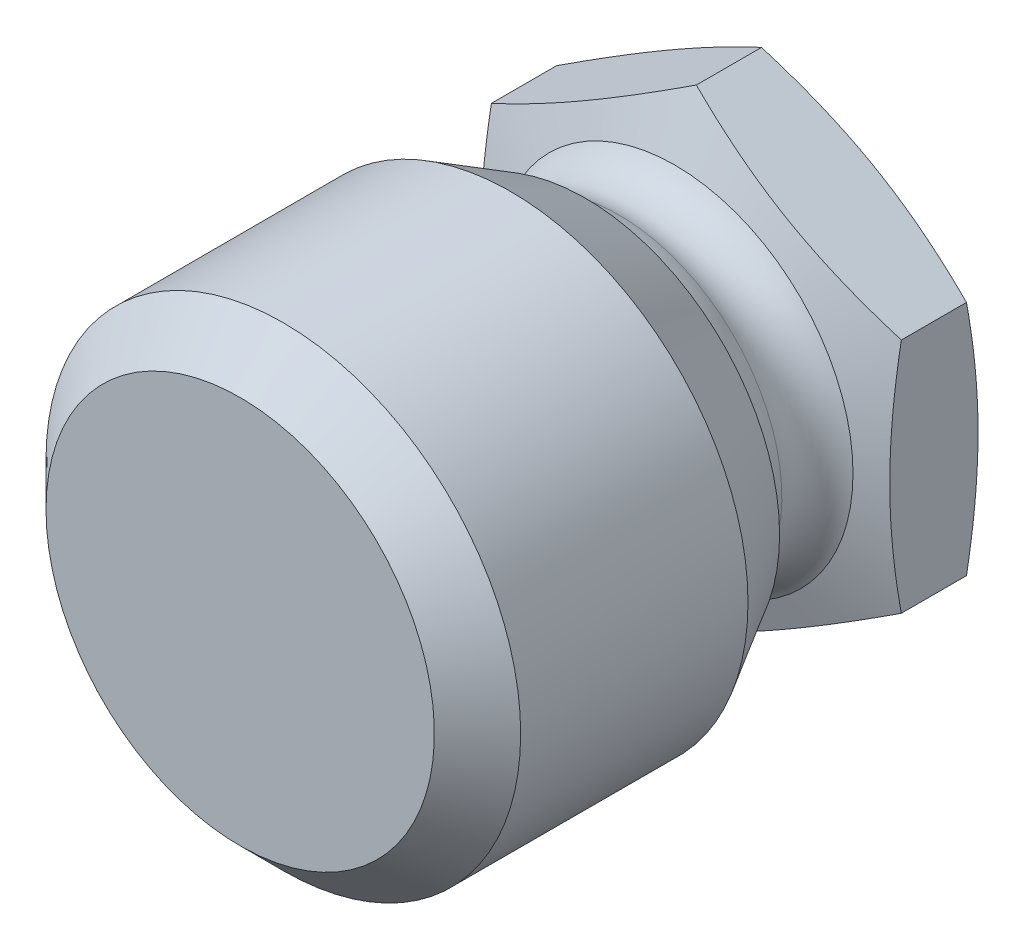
ISO-10303-21;
HEADER;
FILE_DESCRIPTION(('STEP AP214'),'2;1');
FILE_NAME('part.step','',(''),(''),'','','');
FILE_SCHEMA(('AUTOMOTIVE_DESIGN { 1 0 10303 214 1 1 1 1 }'));
ENDSEC;
DATA;
#1=APPLICATION_CONTEXT('core data for automotive mechanical design processes');
#2=APPLICATION_PROTOCOL_DEFINITION('international standard','automotive_design',2000,#1);
#3=PRODUCT_CONTEXT('',#1,'mechanical');
#4=PRODUCT('Part','Part','',(#3));
#5=PRODUCT_RELATED_PRODUCT_CATEGORY('part','',(#4));
#6=PRODUCT_DEFINITION_FORMATION('','',#4);
#7=PRODUCT_DEFINITION_CONTEXT('part definition',#1,'design');
#8=PRODUCT_DEFINITION('design','',#6,#7);
#9=PRODUCT_DEFINITION_SHAPE('','',#8);
#10=(LENGTH_UNIT() NAMED_UNIT(*) SI_UNIT(.MILLI.,.METRE.));
#11=(NAMED_UNIT(*) PLANE_ANGLE_UNIT() SI_UNIT($,.RADIAN.));
#12=(NAMED_UNIT(*) SI_UNIT($,.STERADIAN.) SOLID_ANGLE_UNIT());
#13=UNCERTAINTY_MEASURE_WITH_UNIT(LENGTH_MEASURE(1.E-05),#10,'distance_accuracy_value','');
#14=(GEOMETRIC_REPRESENTATION_CONTEXT(3) GLOBAL_UNCERTAINTY_ASSIGNED_CONTEXT((#13)) GLOBAL_UNIT_ASSIGNED_CONTEXT((#10,
#11,#12)) REPRESENTATION_CONTEXT('',''));
#15=CARTESIAN_POINT('',(0.,0.,0.));
#16=DIRECTION('',(0.,0.,1.));
#17=DIRECTION('',(1.,0.,0.));
#18=AXIS2_PLACEMENT_3D('',#15,#16,#17);
#19=CARTESIAN_POINT('',(0.,0.,11.5));
#20=DIRECTION('',(0.,0.,-1.));
#21=DIRECTION('',(0.,-1.,0.));
#22=AXIS2_PLACEMENT_3D('',#19,#20,#21);
#23=SPHERICAL_SURFACE('',#22,8.5);
#24=CARTESIAN_POINT('',(0.,0.,7.60077445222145));
#25=DIRECTION('',(0.,0.,1.));
#26=DIRECTION('',(0.,-1.,0.));
#27=AXIS2_PLACEMENT_3D('',#24,#25,#26);
#28=CIRCLE('',#27,7.55288290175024);
#29=CARTESIAN_POINT('',(0.,-7.55288290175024,7.60077445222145));
#30=VERTEX_POINT('',#29);
#31=EDGE_CURVE('E77',#30,#30,#28,.T.);
#32=CARTESIAN_POINT('',(0.,0.,9.1526727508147));
#33=DIRECTION('',(0.,0.,1.));
#34=DIRECTION('',(0.,-1.,0.));
#35=AXIS2_PLACEMENT_3D('',#32,#33,#34);
#36=CIRCLE('',#35,8.16945865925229);
#37=CARTESIAN_POINT('',(0.,-8.16945865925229,9.1526727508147));
#38=VERTEX_POINT('',#37);
#39=EDGE_CURVE('E9',#38,#38,#36,.T.);
#40=CARTESIAN_POINT('',(0.,-7.55288290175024,7.60077445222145));
#41=CARTESIAN_POINT('',(0.,-7.56087532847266,7.6162559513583));
#42=CARTESIAN_POINT('',(0.,-7.56882015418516,7.63176202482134));
#43=CARTESIAN_POINT('',(0.,-7.58461430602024,7.66282273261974));
#44=CARTESIAN_POINT('',(0.,-7.59246363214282,7.67837736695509));
#45=CARTESIAN_POINT('',(0.,-7.60806648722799,7.70953460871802));
#46=CARTESIAN_POINT('',(0.,-7.61582001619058,7.72513721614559));
#47=CARTESIAN_POINT('',(0.,-7.6312309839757,7.75638981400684));
#48=CARTESIAN_POINT('',(0.,-7.63888842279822,7.77203980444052));
#49=CARTESIAN_POINT('',(0.,-7.65410692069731,7.80338657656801));
#50=CARTESIAN_POINT('',(0.,-7.66166797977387,7.81908335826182));
#51=CARTESIAN_POINT('',(0.,-7.67669343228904,7.85052311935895));
#52=CARTESIAN_POINT('',(0.,-7.68415782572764,7.86626609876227));
#53=CARTESIAN_POINT('',(0.,-7.69898966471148,7.8977976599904));
#54=CARTESIAN_POINT('',(0.,-7.70635711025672,7.91358624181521));
#55=CARTESIAN_POINT('',(0.,-7.72099477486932,7.94520841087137));
#56=CARTESIAN_POINT('',(0.,-7.72826499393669,7.96104199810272));
#57=CARTESIAN_POINT('',(0.,-7.74270793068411,7.99275357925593));
#58=CARTESIAN_POINT('',(0.,-7.74988064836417,8.00863157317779));
#59=CARTESIAN_POINT('',(0.,-7.76412831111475,8.04043136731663));
#60=CARTESIAN_POINT('',(0.,-7.77120325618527,8.05635316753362));
#61=CARTESIAN_POINT('',(0.,-7.78525510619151,8.08823997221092));
#62=CARTESIAN_POINT('',(0.,-7.79223201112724,8.10420497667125));
#63=CARTESIAN_POINT('',(0.,-7.80608751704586,8.13617758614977));
#64=CARTESIAN_POINT('',(0.,-7.81296611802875,8.15218519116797));
#65=CARTESIAN_POINT('',(0.,-7.82662475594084,8.18424239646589));
#66=CARTESIAN_POINT('',(0.,-7.83340479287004,8.20029199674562));
#67=CARTESIAN_POINT('',(0.,-7.84686604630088,8.23243258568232));
#68=CARTESIAN_POINT('',(0.,-7.85354726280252,8.24852357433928));
#69=CARTESIAN_POINT('',(0.,-7.86681062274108,8.28074633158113));
#70=CARTESIAN_POINT('',(0.,-7.87339276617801,8.29687810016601));
#71=CARTESIAN_POINT('',(0.,-7.88645773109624,8.32918180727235));
#72=CARTESIAN_POINT('',(0.,-7.89294055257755,8.34535374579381));
#73=CARTESIAN_POINT('',(0.,-7.90580662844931,8.37773718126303));
#74=CARTESIAN_POINT('',(0.,-7.91218988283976,8.39394867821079));
#75=CARTESIAN_POINT('',(0.,-7.9248565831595,8.4264106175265));
#76=CARTESIAN_POINT('',(0.,-7.93114002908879,8.44266105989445));
#77=CARTESIAN_POINT('',(0.,-7.94360687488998,8.47520027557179));
#78=CARTESIAN_POINT('',(0.,-7.94979027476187,8.49148904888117));
#79=CARTESIAN_POINT('',(0.,-7.96205679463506,8.52410431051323));
#80=CARTESIAN_POINT('',(0.,-7.96813991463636,8.5404307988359));
#81=CARTESIAN_POINT('',(0.,-7.98020564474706,8.57312087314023));
#82=CARTESIAN_POINT('',(0.,-7.98618825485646,8.58948445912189));
#83=CARTESIAN_POINT('',(0.,-7.99805273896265,8.62224810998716));
#84=CARTESIAN_POINT('',(0.,-8.00393461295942,8.63864817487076));
#85=CARTESIAN_POINT('',(0.,-8.01559740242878,8.67148416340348));
#86=CARTESIAN_POINT('',(0.,-8.02137831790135,8.68792008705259));
#87=CARTESIAN_POINT('',(0.,-8.03283897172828,8.72082717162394));
#88=CARTESIAN_POINT('',(0.,-8.03851871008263,8.73729833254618));
#89=CARTESIAN_POINT('',(0.,-8.04977679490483,8.77027526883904));
#90=CARTESIAN_POINT('',(0.,-8.05535514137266,8.78678104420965));
#91=CARTESIAN_POINT('',(0.,-8.06641023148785,8.81982658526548));
#92=CARTESIAN_POINT('',(0.,-8.07188697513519,8.8363663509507));
#93=CARTESIAN_POINT('',(0.,-8.08273865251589,8.86947924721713));
#94=CARTESIAN_POINT('',(0.,-8.08811358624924,8.88605237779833));
#95=CARTESIAN_POINT('',(0.,-8.09876144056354,8.91923137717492));
#96=CARTESIAN_POINT('',(0.,-8.10403436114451,8.9358372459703));
#97=CARTESIAN_POINT('',(0.,-8.11447798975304,8.96908109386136));
#98=CARTESIAN_POINT('',(0.,-8.11964869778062,8.98571907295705));
#99=CARTESIAN_POINT('',(0.,-8.12988770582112,9.0190265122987));
#100=CARTESIAN_POINT('',(0.,-8.13495600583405,9.03569597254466));
#101=CARTESIAN_POINT('',(0.,-8.14499000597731,9.06906574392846));
#102=CARTESIAN_POINT('',(0.,-8.14995570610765,9.0857660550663));
#103=CARTESIAN_POINT('',(0.,-8.15978431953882,9.11919689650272));
#104=CARTESIAN_POINT('',(0.,-8.16464723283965,9.13592742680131));
#105=CARTESIAN_POINT('',(0.,-8.16945865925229,9.1526727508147));
#106=B_SPLINE_CURVE_WITH_KNOTS('',3,(#40,#41,#42,#43,#44,#45,#46,#47,#48,#49,#50,#51,#52,#53,
#54,#55,#56,#57,#58,#59,#60,#61,#62,#63,#64,#65,#66,#67,#68,#69,#70,#71,#72,#73,#74,#75,#76,#77,
#78,#79,#80,#81,#82,#83,#84,#85,#86,#87,#88,#89,#90,#91,#92,#93,#94,#95,#96,#97,#98,#99,#100,
#101,#102,#103,#104,#105),.UNSPECIFIED.,.F.,.F.,(4,2,2,2,2,2,2,2,2,2,2,2,2,2,2,2,2,2,2,2,2,2,2,
2,2,2,2,2,2,2,2,2,4),(0.,0.0522684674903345,0.104536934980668,0.156805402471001,
0.209073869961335,0.261342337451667,0.313610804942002,0.365879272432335,0.418147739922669,
0.470416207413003,0.522684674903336,0.57495314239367,0.627221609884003,0.679490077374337,
0.731758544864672,0.784027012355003,0.836295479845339,0.888563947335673,0.940832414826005,
0.993100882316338,1.04536934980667,1.09763781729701,1.14990628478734,1.20217475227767,
1.25444321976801,1.30671168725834,1.35898015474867,1.41124862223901,1.46351708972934,
1.51578555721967,1.56805402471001,1.62032249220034,1.67259095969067),.UNSPECIFIED.);
#107=EDGE_CURVE('BSEAM15',#30,#38,#106,.T.);
#108=ORIENTED_EDGE('',*,*,#31,.T.);
#109=ORIENTED_EDGE('',*,*,#39,.F.);
#110=ORIENTED_EDGE('',*,*,#107,.T.);
#111=ORIENTED_EDGE('',*,*,#107,.F.);
#112=EDGE_LOOP('',(#108,#110,#109,#111));
#113=FACE_BOUND('',#112,.T.);
#114=ADVANCED_FACE('F15',(#113),#23,.T.);
#115=CARTESIAN_POINT('',(-9.5,5.48482755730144,5.));
#116=DIRECTION('',(1.,0.,0.));
#117=DIRECTION('',(0.,1.,0.));
#118=AXIS2_PLACEMENT_3D('',#115,#116,#117);
#119=PLANE('',#118);
#120=CARTESIAN_POINT('',(-9.5,14.7665834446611,3.38802795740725));
#121=CARTESIAN_POINT('',(-9.5,14.3338152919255,3.25559531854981));
#122=CARTESIAN_POINT('',(-9.5,13.9005820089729,3.12465578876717));
#123=CARTESIAN_POINT('',(-9.5,13.0329475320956,2.86658917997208));
#124=CARTESIAN_POINT('',(-9.5,12.5985462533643,2.73946238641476));
#125=CARTESIAN_POINT('',(-9.5,11.7276656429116,2.48965608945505));
#126=CARTESIAN_POINT('',(-9.5,11.2911840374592,2.36698448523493));
#127=CARTESIAN_POINT('',(-9.5,10.4166295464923,2.12745917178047));
#128=CARTESIAN_POINT('',(-9.5,9.97855668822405,2.01060536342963));
#129=CARTESIAN_POINT('',(-9.5,9.10628053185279,1.78564537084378));
#130=CARTESIAN_POINT('',(-9.5,8.67210173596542,1.67744463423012));
#131=CARTESIAN_POINT('',(-9.5,7.80161296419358,1.46989041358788));
#132=CARTESIAN_POINT('',(-9.5,7.36530295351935,1.37053707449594));
#133=CARTESIAN_POINT('',(-9.5,6.49039609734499,1.18290891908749));
#134=CARTESIAN_POINT('',(-9.5,6.05179982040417,1.0946314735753));
#135=CARTESIAN_POINT('',(-9.5,5.17205208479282,0.931775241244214));
#136=CARTESIAN_POINT('',(-9.5,4.73090070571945,0.857196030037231));
#137=CARTESIAN_POINT('',(-9.5,3.89503897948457,0.732027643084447));
#138=CARTESIAN_POINT('',(-9.5,3.50059187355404,0.679696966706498));
#139=CARTESIAN_POINT('',(-9.5,2.70995753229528,0.590293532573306));
#140=CARTESIAN_POINT('',(-9.5,2.31377034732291,0.553220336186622));
#141=CARTESIAN_POINT('',(-9.5,1.52047707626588,0.496113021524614));
#142=CARTESIAN_POINT('',(-9.5,1.12337201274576,0.476064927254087));
#143=CARTESIAN_POINT('',(-9.5,0.328656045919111,0.454025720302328));
#144=CARTESIAN_POINT('',(-9.5,-0.0689548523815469,0.452034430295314));
#145=CARTESIAN_POINT('',(-9.5,-0.866182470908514,0.466261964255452));
#146=CARTESIAN_POINT('',(-9.5,-1.26579724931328,0.482587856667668));
#147=CARTESIAN_POINT('',(-9.5,-2.06391915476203,0.532727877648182));
#148=CARTESIAN_POINT('',(-9.5,-2.46242625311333,0.566542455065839));
#149=CARTESIAN_POINT('',(-9.5,-3.25813207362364,0.650027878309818));
#150=CARTESIAN_POINT('',(-9.5,-3.65532920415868,0.699713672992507));
#151=CARTESIAN_POINT('',(-9.5,-4.44772898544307,0.812851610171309));
#152=CARTESIAN_POINT('',(-9.5,-4.84293164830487,0.876303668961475));
#153=CARTESIAN_POINT('',(-9.5,-5.71810618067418,1.03008061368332));
#154=CARTESIAN_POINT('',(-9.5,-6.19757540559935,1.12324615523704));
#155=CARTESIAN_POINT('',(-9.5,-7.15366035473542,1.32331640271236));
#156=CARTESIAN_POINT('',(-9.5,-7.63027572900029,1.4302227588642));
#157=CARTESIAN_POINT('',(-9.5,-8.58115685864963,1.65486159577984));
#158=CARTESIAN_POINT('',(-9.5,-9.05542145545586,1.77259894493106));
#159=CARTESIAN_POINT('',(-9.5,-10.0017412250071,2.01651614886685));
#160=CARTESIAN_POINT('',(-9.5,-10.4737964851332,2.14269566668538));
#161=CARTESIAN_POINT('',(-9.5,-11.41695218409,2.40194140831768));
#162=CARTESIAN_POINT('',(-9.5,-11.8880491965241,2.53502004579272));
#163=CARTESIAN_POINT('',(-9.5,-12.828716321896,2.80646422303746));
#164=CARTESIAN_POINT('',(-9.5,-13.2982864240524,2.94482980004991));
#165=CARTESIAN_POINT('',(-9.5,-14.2360356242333,3.22575168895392));
#166=CARTESIAN_POINT('',(-9.5,-14.7042150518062,3.36830690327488));
#167=CARTESIAN_POINT('',(-9.5,-15.6395152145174,3.65683694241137));
#168=CARTESIAN_POINT('',(-9.50000000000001,-16.1066359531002,3.80281175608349));
#169=CARTESIAN_POINT('',(-9.50000000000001,-17.4930559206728,4.24058818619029));
#170=CARTESIAN_POINT('',(-9.50000000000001,-18.4110931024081,4.53638479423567));
#171=CARTESIAN_POINT('',(-9.50000000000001,-20.2448138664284,5.13537855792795));
#172=CARTESIAN_POINT('',(-9.50000000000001,-21.1604972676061,5.43857626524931));
#173=CARTESIAN_POINT('',(-9.50000000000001,-22.985644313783,6.04877194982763));
#174=CARTESIAN_POINT('',(-9.50000000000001,-23.8951165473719,6.3557442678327));
#175=CARTESIAN_POINT('',(-9.50000000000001,-25.2582914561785,6.8190826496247));
#176=CARTESIAN_POINT('',(-9.50000000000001,-25.712487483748,6.97400070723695));
#177=CARTESIAN_POINT('',(-9.50000000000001,-26.6205896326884,7.28468140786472));
#178=CARTESIAN_POINT('',(-9.5,-27.0744957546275,7.44044404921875));
#179=CARTESIAN_POINT('',(-9.5,-27.5282772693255,7.59656904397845));
#180=B_SPLINE_CURVE_WITH_KNOTS('',3,(#120,#121,#122,#123,#124,#125,#126,#127,#128,#129,#130,
#131,#132,#133,#134,#135,#136,#137,#138,#139,#140,#141,#142,#143,#144,#145,#146,#147,#148,#149,
#150,#151,#152,#153,#154,#155,#156,#157,#158,#159,#160,#161,#162,#163,#164,#165,#166,#167,#168,
#169,#170,#171,#172,#173,#174,#175,#176,#177,#178,#179),.UNSPECIFIED.,.F.,.F.,(4,2,2,2,2,2,2,2,
2,2,2,2,2,2,2,2,2,2,2,2,2,2,2,2,2,2,2,2,2,4),(0.,1.35774251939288,2.71558643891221,
4.0757307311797,5.43585184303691,6.77815254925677,8.12047524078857,9.46247868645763,
10.8044405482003,11.9978949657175,13.1913150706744,14.3837545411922,15.5761823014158,
16.7756165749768,17.975081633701,19.1756797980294,20.3762706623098,21.8413152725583,
23.3065359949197,24.7724185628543,26.2382426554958,27.706802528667,29.1753727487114,
30.6435616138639,32.1117456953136,35.005235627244,37.8989419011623,40.7785725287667,
42.2182395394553,43.6579037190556),.UNSPECIFIED.);
#181=CARTESIAN_POINT('',(-9.5,-5.48482755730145,0.989873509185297));
#182=VERTEX_POINT('',#181);
#183=CARTESIAN_POINT('',(-9.5,5.48482755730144,0.989873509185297));
#184=VERTEX_POINT('',#183);
#185=EDGE_CURVE('E71',#182,#184,#180,.F.);
#186=ORIENTED_EDGE('',*,*,#185,.F.);
#187=DIRECTION('',(0.,0.,-1.));
#188=VECTOR('',#187,1.);
#189=CARTESIAN_POINT('',(-9.5,-5.48482755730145,5.));
#190=LINE('',#189,#188);
#191=CARTESIAN_POINT('',(-9.5,-5.48482755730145,4.0101264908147));
#192=VERTEX_POINT('',#191);
#193=EDGE_CURVE('E84',#192,#182,#190,.T.);
#194=ORIENTED_EDGE('',*,*,#193,.F.);
#195=CARTESIAN_POINT('',(-9.5,14.7665834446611,1.61197204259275));
#196=CARTESIAN_POINT('',(-9.5,14.3338152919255,1.74440468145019));
#197=CARTESIAN_POINT('',(-9.5,13.9005820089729,1.87534421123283));
#198=CARTESIAN_POINT('',(-9.5,13.0329475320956,2.13341082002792));
#199=CARTESIAN_POINT('',(-9.5,12.5985462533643,2.26053761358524));
#200=CARTESIAN_POINT('',(-9.5,11.7276656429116,2.51034391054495));
#201=CARTESIAN_POINT('',(-9.5,11.2911840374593,2.63301551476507));
#202=CARTESIAN_POINT('',(-9.5,10.4166295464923,2.87254082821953));
#203=CARTESIAN_POINT('',(-9.5,9.97855668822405,2.98939463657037));
#204=CARTESIAN_POINT('',(-9.5,9.10628053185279,3.21435462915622));
#205=CARTESIAN_POINT('',(-9.5,8.67210173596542,3.32255536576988));
#206=CARTESIAN_POINT('',(-9.5,7.80161296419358,3.53010958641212));
#207=CARTESIAN_POINT('',(-9.5,7.36530295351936,3.62946292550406));
#208=CARTESIAN_POINT('',(-9.5,6.49039609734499,3.81709108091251));
#209=CARTESIAN_POINT('',(-9.5,6.05179982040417,3.9053685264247));
#210=CARTESIAN_POINT('',(-9.5,5.17205208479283,4.06822475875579));
#211=CARTESIAN_POINT('',(-9.5,4.73090070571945,4.14280396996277));
#212=CARTESIAN_POINT('',(-9.5,3.89503897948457,4.26797235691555));
#213=CARTESIAN_POINT('',(-9.5,3.50059187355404,4.3203030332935));
#214=CARTESIAN_POINT('',(-9.5,2.70995753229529,4.40970646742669));
#215=CARTESIAN_POINT('',(-9.5,2.31377034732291,4.44677966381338));
#216=CARTESIAN_POINT('',(-9.5,1.52047707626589,4.50388697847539));
#217=CARTESIAN_POINT('',(-9.5,1.12337201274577,4.52393507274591));
#218=CARTESIAN_POINT('',(-9.5,0.328656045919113,4.54597427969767));
#219=CARTESIAN_POINT('',(-9.5,-0.0689548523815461,4.54796556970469));
#220=CARTESIAN_POINT('',(-9.5,-0.866182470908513,4.53373803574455));
#221=CARTESIAN_POINT('',(-9.5,-1.26579724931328,4.51741214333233));
#222=CARTESIAN_POINT('',(-9.5,-2.06391915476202,4.46727212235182));
#223=CARTESIAN_POINT('',(-9.5,-2.46242625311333,4.43345754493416));
#224=CARTESIAN_POINT('',(-9.5,-3.25813207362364,4.34997212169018));
#225=CARTESIAN_POINT('',(-9.5,-3.65532920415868,4.30028632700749));
#226=CARTESIAN_POINT('',(-9.5,-4.44772898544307,4.18714838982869));
#227=CARTESIAN_POINT('',(-9.5,-4.84293164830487,4.12369633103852));
#228=CARTESIAN_POINT('',(-9.5,-5.71810618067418,3.96991938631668));
#229=CARTESIAN_POINT('',(-9.5,-6.19757540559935,3.87675384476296));
#230=CARTESIAN_POINT('',(-9.5,-7.15366035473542,3.67668359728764));
#231=CARTESIAN_POINT('',(-9.5,-7.63027572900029,3.5697772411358));
#232=CARTESIAN_POINT('',(-9.5,-8.58115685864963,3.34513840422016));
#233=CARTESIAN_POINT('',(-9.5,-9.05542145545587,3.22740105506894));
#234=CARTESIAN_POINT('',(-9.5,-10.0017412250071,2.98348385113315));
#235=CARTESIAN_POINT('',(-9.5,-10.4737964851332,2.85730433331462));
#236=CARTESIAN_POINT('',(-9.5,-11.41695218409,2.59805859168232));
#237=CARTESIAN_POINT('',(-9.5,-11.8880491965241,2.46497995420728));
#238=CARTESIAN_POINT('',(-9.5,-12.8287163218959,2.19353577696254));
#239=CARTESIAN_POINT('',(-9.5,-13.2982864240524,2.05517019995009));
#240=CARTESIAN_POINT('',(-9.5,-14.2360356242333,1.77424831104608));
#241=CARTESIAN_POINT('',(-9.5,-14.7042150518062,1.63169309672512));
#242=CARTESIAN_POINT('',(-9.5,-15.6395152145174,1.34316305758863));
#243=CARTESIAN_POINT('',(-9.50000000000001,-16.1066359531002,1.19718824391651));
#244=CARTESIAN_POINT('',(-9.50000000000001,-17.4930559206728,0.759411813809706));
#245=CARTESIAN_POINT('',(-9.50000000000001,-18.4110931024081,0.463615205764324));
#246=CARTESIAN_POINT('',(-9.50000000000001,-20.2448138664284,-0.135378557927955));
#247=CARTESIAN_POINT('',(-9.50000000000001,-21.1604972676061,-0.438576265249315));
#248=CARTESIAN_POINT('',(-9.50000000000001,-22.9856443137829,-1.04877194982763));
#249=CARTESIAN_POINT('',(-9.50000000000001,-23.8951165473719,-1.3557442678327));
#250=CARTESIAN_POINT('',(-9.50000000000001,-25.2582914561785,-1.8190826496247));
#251=CARTESIAN_POINT('',(-9.50000000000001,-25.712487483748,-1.97400070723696));
#252=CARTESIAN_POINT('',(-9.50000000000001,-26.6205896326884,-2.28468140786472));
#253=CARTESIAN_POINT('',(-9.5,-27.0744957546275,-2.44044404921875));
#254=CARTESIAN_POINT('',(-9.5,-27.5282772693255,-2.59656904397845));
#255=B_SPLINE_CURVE_WITH_KNOTS('',3,(#195,#196,#197,#198,#199,#200,#201,#202,#203,#204,#205,
#206,#207,#208,#209,#210,#211,#212,#213,#214,#215,#216,#217,#218,#219,#220,#221,#222,#223,#224,
#225,#226,#227,#228,#229,#230,#231,#232,#233,#234,#235,#236,#237,#238,#239,#240,#241,#242,#243,
#244,#245,#246,#247,#248,#249,#250,#251,#252,#253,#254),.UNSPECIFIED.,.F.,.F.,(4,2,2,2,2,2,2,2,
2,2,2,2,2,2,2,2,2,2,2,2,2,2,2,2,2,2,2,2,2,4),(0.,1.35774251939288,2.71558643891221,
4.07573073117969,5.43585184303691,6.77815254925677,8.12047524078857,9.46247868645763,
10.8044405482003,11.9978949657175,13.1913150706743,14.3837545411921,15.5761823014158,
16.7756165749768,17.975081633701,19.1756797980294,20.3762706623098,21.8413152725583,
23.3065359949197,24.7724185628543,26.2382426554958,27.706802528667,29.1753727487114,
30.6435616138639,32.1117456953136,35.005235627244,37.8989419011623,40.7785725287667,
42.2182395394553,43.6579037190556),.UNSPECIFIED.);
#256=CARTESIAN_POINT('',(-9.5,5.48482755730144,4.0101264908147));
#257=VERTEX_POINT('',#256);
#258=EDGE_CURVE('E78',#257,#192,#255,.T.);
#259=ORIENTED_EDGE('',*,*,#258,.F.);
#260=DIRECTION('',(0.,0.,-1.));
#261=VECTOR('',#260,1.);
#262=CARTESIAN_POINT('',(-9.5,5.48482755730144,5.));
#263=LINE('',#262,#261);
#264=EDGE_CURVE('E86',#257,#184,#263,.T.);
#265=ORIENTED_EDGE('',*,*,#264,.T.);
#266=EDGE_LOOP('',(#186,#194,#259,#265));
#267=FACE_BOUND('',#266,.T.);
#268=ADVANCED_FACE('F83',(#267),#119,.F.);
#269=CARTESIAN_POINT('',(0.,10.9696551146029,5.));
#270=DIRECTION('',(0.5,-0.866025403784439,0.));
#271=DIRECTION('',(0.866025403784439,0.5,0.));
#272=AXIS2_PLACEMENT_3D('',#269,#270,#271);
#273=PLANE('',#272);
#274=CARTESIAN_POINT('',(-9.5002,5.4847120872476,0.989915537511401));
#275=CARTESIAN_POINT('',(-9.1067676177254,5.71186037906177,0.907210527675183));
#276=CARTESIAN_POINT('',(-8.71203788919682,5.9397576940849,0.831976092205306));
#277=CARTESIAN_POINT('',(-7.92001193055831,6.39703409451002,0.699612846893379));
#278=CARTESIAN_POINT('',(-7.52271393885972,6.62641419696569,0.642498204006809));
#279=CARTESIAN_POINT('',(-6.72996042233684,7.0841106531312,0.550116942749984));
#280=CARTESIAN_POINT('',(-6.33452300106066,7.31241655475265,0.514648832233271));
#281=CARTESIAN_POINT('',(-5.54272345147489,7.76956223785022,0.467076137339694));
#282=CARTESIAN_POINT('',(-5.14636172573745,7.9984017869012,0.454962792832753));
#283=CARTESIAN_POINT('',(-4.35363827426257,8.45608088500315,0.454962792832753));
#284=CARTESIAN_POINT('',(-3.95727654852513,8.68492043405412,0.467076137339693));
#285=CARTESIAN_POINT('',(-3.16547699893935,9.1420661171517,0.51464883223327));
#286=CARTESIAN_POINT('',(-2.77003957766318,9.37037201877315,0.550116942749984));
#287=CARTESIAN_POINT('',(-1.9772860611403,9.82806847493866,0.642498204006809));
#288=CARTESIAN_POINT('',(-1.57998806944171,10.0574485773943,0.699612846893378));
#289=CARTESIAN_POINT('',(-0.787962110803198,10.5147249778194,0.831976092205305));
#290=CARTESIAN_POINT('',(-0.393232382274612,10.7426222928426,0.907210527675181));
#291=CARTESIAN_POINT('',(0.000200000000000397,10.9697705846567,0.989915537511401));
#292=B_SPLINE_CURVE_WITH_KNOTS('',3,(#274,#275,#276,#277,#278,#279,#280,#281,#282,#283,#284,
#285,#286,#287,#288,#289,#290,#291),.UNSPECIFIED.,.F.,.F.,(4,2,2,2,2,2,2,2,4),(0.,
1.38543330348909,2.7719471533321,4.14534984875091,5.51823729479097,6.89112474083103,
8.26452743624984,9.65104128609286,11.0364745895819),.UNSPECIFIED.);
#293=CARTESIAN_POINT('',(0.,10.9696551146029,0.989873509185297));
#294=VERTEX_POINT('',#293);
#295=EDGE_CURVE('E88',#184,#294,#292,.T.);
#296=ORIENTED_EDGE('',*,*,#295,.F.);
#297=ORIENTED_EDGE('',*,*,#264,.F.);
#298=CARTESIAN_POINT('',(0.000200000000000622,10.9697705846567,4.0100844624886));
#299=CARTESIAN_POINT('',(-0.393232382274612,10.7426222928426,4.09278947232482));
#300=CARTESIAN_POINT('',(-0.787962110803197,10.5147249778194,4.1680239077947));
#301=CARTESIAN_POINT('',(-1.57998806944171,10.0574485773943,4.30038715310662));
#302=CARTESIAN_POINT('',(-1.9772860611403,9.82806847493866,4.35750179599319));
#303=CARTESIAN_POINT('',(-2.77003957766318,9.37037201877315,4.44988305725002));
#304=CARTESIAN_POINT('',(-3.16547699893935,9.1420661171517,4.48535116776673));
#305=CARTESIAN_POINT('',(-3.95727654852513,8.68492043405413,4.53292386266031));
#306=CARTESIAN_POINT('',(-4.35363827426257,8.45608088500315,4.54503720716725));
#307=CARTESIAN_POINT('',(-5.14636172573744,7.9984017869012,4.54503720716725));
#308=CARTESIAN_POINT('',(-5.54272345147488,7.76956223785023,4.53292386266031));
#309=CARTESIAN_POINT('',(-6.33452300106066,7.31241655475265,4.48535116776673));
#310=CARTESIAN_POINT('',(-6.72996042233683,7.0841106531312,4.44988305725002));
#311=CARTESIAN_POINT('',(-7.52271393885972,6.62641419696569,4.35750179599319));
#312=CARTESIAN_POINT('',(-7.9200119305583,6.39703409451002,4.30038715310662));
#313=CARTESIAN_POINT('',(-8.71203788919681,5.9397576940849,4.1680239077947));
#314=CARTESIAN_POINT('',(-9.1067676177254,5.71186037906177,4.09278947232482));
#315=CARTESIAN_POINT('',(-9.5002,5.48471208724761,4.0100844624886));
#316=B_SPLINE_CURVE_WITH_KNOTS('',3,(#298,#299,#300,#301,#302,#303,#304,#305,#306,#307,#308,
#309,#310,#311,#312,#313,#314,#315),.UNSPECIFIED.,.F.,.F.,(4,2,2,2,2,2,2,2,4),(0.,
1.38543330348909,2.7719471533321,4.14534984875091,5.51823729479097,6.89112474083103,
8.26452743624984,9.65104128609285,11.0364745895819),.UNSPECIFIED.);
#317=CARTESIAN_POINT('',(0.,10.9696551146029,4.0101264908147));
#318=VERTEX_POINT('',#317);
#319=EDGE_CURVE('E41',#318,#257,#316,.T.);
#320=ORIENTED_EDGE('',*,*,#319,.F.);
#321=DIRECTION('',(0.,0.,-1.));
#322=VECTOR('',#321,1.);
#323=CARTESIAN_POINT('',(0.,10.9696551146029,5.));
#324=LINE('',#323,#322);
#325=EDGE_CURVE('E94',#318,#294,#324,.T.);
#326=ORIENTED_EDGE('',*,*,#325,.T.);
#327=EDGE_LOOP('',(#296,#297,#320,#326));
#328=FACE_BOUND('',#327,.T.);
#329=ADVANCED_FACE('F204',(#328),#273,.F.);
#330=CARTESIAN_POINT('',(9.5,5.48482755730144,5.));
#331=DIRECTION('',(-0.5,-0.866025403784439,0.));
#332=DIRECTION('',(0.866025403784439,-0.5,0.));
#333=AXIS2_PLACEMENT_3D('',#330,#331,#332);
#334=PLANE('',#333);
#335=CARTESIAN_POINT('',(-0.000199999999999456,10.9697705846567,0.989915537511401));
#336=CARTESIAN_POINT('',(0.393232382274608,10.7426222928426,0.907210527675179));
#337=CARTESIAN_POINT('',(0.787962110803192,10.5147249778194,0.831976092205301));
#338=CARTESIAN_POINT('',(1.5799880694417,10.0574485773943,0.699612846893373));
#339=CARTESIAN_POINT('',(1.97728606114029,9.82806847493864,0.642498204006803));
#340=CARTESIAN_POINT('',(2.77003957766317,9.37037201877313,0.550116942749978));
#341=CARTESIAN_POINT('',(3.16547699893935,9.14206611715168,0.514648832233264));
#342=CARTESIAN_POINT('',(3.95727654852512,8.68492043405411,0.467076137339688));
#343=CARTESIAN_POINT('',(4.35363827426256,8.45608088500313,0.454962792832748));
#344=CARTESIAN_POINT('',(5.14636172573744,7.99840178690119,0.454962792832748));
#345=CARTESIAN_POINT('',(5.54272345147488,7.76956223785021,0.467076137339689));
#346=CARTESIAN_POINT('',(6.33452300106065,7.31241655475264,0.514648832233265));
#347=CARTESIAN_POINT('',(6.72996042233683,7.08411065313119,0.550116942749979));
#348=CARTESIAN_POINT('',(7.52271393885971,6.62641419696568,0.642498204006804));
#349=CARTESIAN_POINT('',(7.9200119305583,6.39703409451,0.699612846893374));
#350=CARTESIAN_POINT('',(8.71203788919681,5.93975769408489,0.831976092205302));
#351=CARTESIAN_POINT('',(9.10676761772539,5.71186037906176,0.90721052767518));
#352=CARTESIAN_POINT('',(9.5002,5.4847120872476,0.989915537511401));
#353=B_SPLINE_CURVE_WITH_KNOTS('',3,(#335,#336,#337,#338,#339,#340,#341,#342,#343,#344,#345,
#346,#347,#348,#349,#350,#351,#352),.UNSPECIFIED.,.F.,.F.,(4,2,2,2,2,2,2,2,4),(0.,
1.38543330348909,2.7719471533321,4.14534984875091,5.51823729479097,6.89112474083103,
8.26452743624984,9.65104128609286,11.0364745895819),.UNSPECIFIED.);
#354=CARTESIAN_POINT('',(9.5,5.48482755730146,0.989873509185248));
#355=VERTEX_POINT('',#354);
#356=EDGE_CURVE('E191',#294,#355,#353,.T.);
#357=ORIENTED_EDGE('',*,*,#356,.F.);
#358=ORIENTED_EDGE('',*,*,#325,.F.);
#359=CARTESIAN_POINT('',(9.5002,5.4847120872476,4.0100844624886));
#360=CARTESIAN_POINT('',(9.10676761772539,5.71186037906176,4.09278947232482));
#361=CARTESIAN_POINT('',(8.71203788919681,5.93975769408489,4.1680239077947));
#362=CARTESIAN_POINT('',(7.9200119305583,6.39703409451,4.30038715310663));
#363=CARTESIAN_POINT('',(7.52271393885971,6.62641419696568,4.3575017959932));
#364=CARTESIAN_POINT('',(6.72996042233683,7.08411065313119,4.44988305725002));
#365=CARTESIAN_POINT('',(6.33452300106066,7.31241655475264,4.48535116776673));
#366=CARTESIAN_POINT('',(5.54272345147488,7.76956223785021,4.53292386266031));
#367=CARTESIAN_POINT('',(5.14636172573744,7.99840178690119,4.54503720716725));
#368=CARTESIAN_POINT('',(4.35363827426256,8.45608088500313,4.54503720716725));
#369=CARTESIAN_POINT('',(3.95727654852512,8.68492043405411,4.53292386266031));
#370=CARTESIAN_POINT('',(3.16547699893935,9.14206611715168,4.48535116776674));
#371=CARTESIAN_POINT('',(2.77003957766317,9.37037201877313,4.44988305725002));
#372=CARTESIAN_POINT('',(1.97728606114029,9.82806847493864,4.3575017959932));
#373=CARTESIAN_POINT('',(1.5799880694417,10.0574485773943,4.30038715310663));
#374=CARTESIAN_POINT('',(0.787962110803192,10.5147249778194,4.1680239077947));
#375=CARTESIAN_POINT('',(0.393232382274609,10.7426222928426,4.09278947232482));
#376=CARTESIAN_POINT('',(-0.00019999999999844,10.9697705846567,4.0100844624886));
#377=B_SPLINE_CURVE_WITH_KNOTS('',3,(#359,#360,#361,#362,#363,#364,#365,#366,#367,#368,#369,
#370,#371,#372,#373,#374,#375,#376),.UNSPECIFIED.,.F.,.F.,(4,2,2,2,2,2,2,2,4),(0.,
1.38543330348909,2.7719471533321,4.14534984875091,5.51823729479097,6.89112474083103,
8.26452743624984,9.65104128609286,11.0364745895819),.UNSPECIFIED.);
#378=CARTESIAN_POINT('',(9.5,5.48482755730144,4.0101264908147));
#379=VERTEX_POINT('',#378);
#380=EDGE_CURVE('E149',#379,#318,#377,.T.);
#381=ORIENTED_EDGE('',*,*,#380,.F.);
#382=DIRECTION('',(0.,0.,-1.));
#383=VECTOR('',#382,1.);
#384=CARTESIAN_POINT('',(9.5,5.48482755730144,5.));
#385=LINE('',#384,#383);
#386=EDGE_CURVE('E108',#379,#355,#385,.T.);
#387=ORIENTED_EDGE('',*,*,#386,.T.);
#388=EDGE_LOOP('',(#357,#358,#381,#387));
#389=FACE_BOUND('',#388,.T.);
#390=ADVANCED_FACE('F201',(#389),#334,.F.);
#391=CARTESIAN_POINT('',(9.5,-5.48482755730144,5.));
#392=DIRECTION('',(-1.,0.,0.));
#393=DIRECTION('',(0.,0.,-1.));
#394=AXIS2_PLACEMENT_3D('',#391,#392,#393);
#395=PLANE('',#394);
#396=CARTESIAN_POINT('',(9.5,14.7665834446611,3.38802795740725));
#397=CARTESIAN_POINT('',(9.5,14.3338152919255,3.25559531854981));
#398=CARTESIAN_POINT('',(9.5,13.9005820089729,3.12465578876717));
#399=CARTESIAN_POINT('',(9.5,13.0329475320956,2.86658917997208));
#400=CARTESIAN_POINT('',(9.5,12.5985462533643,2.73946238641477));
#401=CARTESIAN_POINT('',(9.5,11.7276656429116,2.48965608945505));
#402=CARTESIAN_POINT('',(9.5,11.2911840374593,2.36698448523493));
#403=CARTESIAN_POINT('',(9.5,10.4166295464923,2.12745917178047));
#404=CARTESIAN_POINT('',(9.5,9.97855668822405,2.01060536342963));
#405=CARTESIAN_POINT('',(9.5,9.10628053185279,1.78564537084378));
#406=CARTESIAN_POINT('',(9.5,8.67210173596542,1.67744463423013));
#407=CARTESIAN_POINT('',(9.5,7.80161296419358,1.46989041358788));
#408=CARTESIAN_POINT('',(9.5,7.36530295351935,1.37053707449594));
#409=CARTESIAN_POINT('',(9.5,6.49039609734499,1.18290891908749));
#410=CARTESIAN_POINT('',(9.5,6.05179982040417,1.0946314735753));
#411=CARTESIAN_POINT('',(9.5,5.17205208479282,0.931775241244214));
#412=CARTESIAN_POINT('',(9.5,4.73090070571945,0.857196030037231));
#413=CARTESIAN_POINT('',(9.5,3.89503897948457,0.732027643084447));
#414=CARTESIAN_POINT('',(9.5,3.50059187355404,0.679696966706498));
#415=CARTESIAN_POINT('',(9.5,2.70995753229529,0.590293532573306));
#416=CARTESIAN_POINT('',(9.5,2.31377034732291,0.553220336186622));
#417=CARTESIAN_POINT('',(9.5,1.52047707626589,0.496113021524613));
#418=CARTESIAN_POINT('',(9.5,1.12337201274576,0.476064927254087));
#419=CARTESIAN_POINT('',(9.5,0.328656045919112,0.454025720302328));
#420=CARTESIAN_POINT('',(9.5,-0.0689548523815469,0.452034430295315));
#421=CARTESIAN_POINT('',(9.5,-0.866182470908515,0.466261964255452));
#422=CARTESIAN_POINT('',(9.5,-1.26579724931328,0.482587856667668));
#423=CARTESIAN_POINT('',(9.5,-2.06391915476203,0.532727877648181));
#424=CARTESIAN_POINT('',(9.5,-2.46242625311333,0.566542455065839));
#425=CARTESIAN_POINT('',(9.5,-3.25813207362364,0.650027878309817));
#426=CARTESIAN_POINT('',(9.5,-3.65532920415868,0.699713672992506));
#427=CARTESIAN_POINT('',(9.5,-4.44772898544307,0.812851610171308));
#428=CARTESIAN_POINT('',(9.5,-4.84293164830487,0.876303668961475));
#429=CARTESIAN_POINT('',(9.5,-5.71810618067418,1.03008061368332));
#430=CARTESIAN_POINT('',(9.5,-6.19757540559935,1.12324615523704));
#431=CARTESIAN_POINT('',(9.5,-7.15366035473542,1.32331640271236));
#432=CARTESIAN_POINT('',(9.5,-7.63027572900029,1.4302227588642));
#433=CARTESIAN_POINT('',(9.5,-8.58115685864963,1.65486159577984));
#434=CARTESIAN_POINT('',(9.5,-9.05542145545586,1.77259894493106));
#435=CARTESIAN_POINT('',(9.5,-10.0017412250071,2.01651614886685));
#436=CARTESIAN_POINT('',(9.5,-10.4737964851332,2.14269566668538));
#437=CARTESIAN_POINT('',(9.5,-11.41695218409,2.40194140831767));
#438=CARTESIAN_POINT('',(9.5,-11.8880491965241,2.53502004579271));
#439=CARTESIAN_POINT('',(9.5,-12.828716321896,2.80646422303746));
#440=CARTESIAN_POINT('',(9.5,-13.2982864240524,2.94482980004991));
#441=CARTESIAN_POINT('',(9.5,-14.2360356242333,3.22575168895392));
#442=CARTESIAN_POINT('',(9.5,-14.7042150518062,3.36830690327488));
#443=CARTESIAN_POINT('',(9.5,-15.6395152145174,3.65683694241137));
#444=CARTESIAN_POINT('',(9.5,-16.1066359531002,3.80281175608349));
#445=CARTESIAN_POINT('',(9.5,-17.4930559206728,4.24058818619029));
#446=CARTESIAN_POINT('',(9.5,-18.4110931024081,4.53638479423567));
#447=CARTESIAN_POINT('',(9.5,-20.2448138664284,5.13537855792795));
#448=CARTESIAN_POINT('',(9.5,-21.1604972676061,5.43857626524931));
#449=CARTESIAN_POINT('',(9.5,-22.9856443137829,6.04877194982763));
#450=CARTESIAN_POINT('',(9.5,-23.8951165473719,6.35574426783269));
#451=CARTESIAN_POINT('',(9.5,-25.2582914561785,6.81908264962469));
#452=CARTESIAN_POINT('',(9.5,-25.712487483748,6.97400070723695));
#453=CARTESIAN_POINT('',(9.5,-26.6205896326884,7.28468140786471));
#454=CARTESIAN_POINT('',(9.5,-27.0744957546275,7.44044404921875));
#455=CARTESIAN_POINT('',(9.5,-27.5282772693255,7.59656904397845));
#456=B_SPLINE_CURVE_WITH_KNOTS('',3,(#396,#397,#398,#399,#400,#401,#402,#403,#404,#405,#406,
#407,#408,#409,#410,#411,#412,#413,#414,#415,#416,#417,#418,#419,#420,#421,#422,#423,#424,#425,
#426,#427,#428,#429,#430,#431,#432,#433,#434,#435,#436,#437,#438,#439,#440,#441,#442,#443,#444,
#445,#446,#447,#448,#449,#450,#451,#452,#453,#454,#455),.UNSPECIFIED.,.F.,.F.,(4,2,2,2,2,2,2,2,
2,2,2,2,2,2,2,2,2,2,2,2,2,2,2,2,2,2,2,2,2,4),(0.,1.35774251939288,2.71558643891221,
4.07573073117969,5.43585184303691,6.77815254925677,8.12047524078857,9.46247868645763,
10.8044405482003,11.9978949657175,13.1913150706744,14.3837545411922,15.5761823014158,
16.7756165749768,17.975081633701,19.1756797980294,20.3762706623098,21.8413152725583,
23.3065359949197,24.7724185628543,26.2382426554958,27.706802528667,29.1753727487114,
30.6435616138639,32.1117456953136,35.005235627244,37.8989419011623,40.7785725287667,
42.2182395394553,43.6579037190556),.UNSPECIFIED.);
#457=CARTESIAN_POINT('',(9.5,-5.48482755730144,0.989873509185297));
#458=VERTEX_POINT('',#457);
#459=EDGE_CURVE('E183',#355,#458,#456,.T.);
#460=ORIENTED_EDGE('',*,*,#459,.F.);
#461=ORIENTED_EDGE('',*,*,#386,.F.);
#462=CARTESIAN_POINT('',(9.5,14.7665834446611,1.61197204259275));
#463=CARTESIAN_POINT('',(9.5,14.3338152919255,1.74440468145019));
#464=CARTESIAN_POINT('',(9.5,13.9005820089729,1.87534421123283));
#465=CARTESIAN_POINT('',(9.5,13.0329475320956,2.13341082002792));
#466=CARTESIAN_POINT('',(9.5,12.5985462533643,2.26053761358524));
#467=CARTESIAN_POINT('',(9.5,11.7276656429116,2.51034391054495));
#468=CARTESIAN_POINT('',(9.5,11.2911840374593,2.63301551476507));
#469=CARTESIAN_POINT('',(9.5,10.4166295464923,2.87254082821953));
#470=CARTESIAN_POINT('',(9.5,9.97855668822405,2.98939463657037));
#471=CARTESIAN_POINT('',(9.5,9.10628053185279,3.21435462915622));
#472=CARTESIAN_POINT('',(9.5,8.67210173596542,3.32255536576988));
#473=CARTESIAN_POINT('',(9.5,7.80161296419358,3.53010958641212));
#474=CARTESIAN_POINT('',(9.5,7.36530295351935,3.62946292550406));
#475=CARTESIAN_POINT('',(9.5,6.49039609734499,3.81709108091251));
#476=CARTESIAN_POINT('',(9.5,6.05179982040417,3.9053685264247));
#477=CARTESIAN_POINT('',(9.5,5.17205208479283,4.06822475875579));
#478=CARTESIAN_POINT('',(9.5,4.73090070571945,4.14280396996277));
#479=CARTESIAN_POINT('',(9.5,3.89503897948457,4.26797235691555));
#480=CARTESIAN_POINT('',(9.5,3.50059187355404,4.3203030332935));
#481=CARTESIAN_POINT('',(9.5,2.70995753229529,4.4097064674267));
#482=CARTESIAN_POINT('',(9.5,2.31377034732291,4.44677966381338));
#483=CARTESIAN_POINT('',(9.5,1.52047707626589,4.50388697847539));
#484=CARTESIAN_POINT('',(9.5,1.12337201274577,4.52393507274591));
#485=CARTESIAN_POINT('',(9.5,0.328656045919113,4.54597427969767));
#486=CARTESIAN_POINT('',(9.5,-0.0689548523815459,4.54796556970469));
#487=CARTESIAN_POINT('',(9.5,-0.866182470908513,4.53373803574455));
#488=CARTESIAN_POINT('',(9.5,-1.26579724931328,4.51741214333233));
#489=CARTESIAN_POINT('',(9.5,-2.06391915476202,4.46727212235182));
#490=CARTESIAN_POINT('',(9.5,-2.46242625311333,4.43345754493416));
#491=CARTESIAN_POINT('',(9.5,-3.25813207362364,4.34997212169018));
#492=CARTESIAN_POINT('',(9.5,-3.65532920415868,4.30028632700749));
#493=CARTESIAN_POINT('',(9.5,-4.44772898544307,4.18714838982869));
#494=CARTESIAN_POINT('',(9.5,-4.84293164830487,4.12369633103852));
#495=CARTESIAN_POINT('',(9.5,-5.71810618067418,3.96991938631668));
#496=CARTESIAN_POINT('',(9.5,-6.19757540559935,3.87675384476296));
#497=CARTESIAN_POINT('',(9.5,-7.15366035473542,3.67668359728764));
#498=CARTESIAN_POINT('',(9.5,-7.63027572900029,3.5697772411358));
#499=CARTESIAN_POINT('',(9.5,-8.58115685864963,3.34513840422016));
#500=CARTESIAN_POINT('',(9.5,-9.05542145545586,3.22740105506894));
#501=CARTESIAN_POINT('',(9.5,-10.0017412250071,2.98348385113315));
#502=CARTESIAN_POINT('',(9.5,-10.4737964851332,2.85730433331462));
#503=CARTESIAN_POINT('',(9.5,-11.41695218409,2.59805859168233));
#504=CARTESIAN_POINT('',(9.5,-11.8880491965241,2.46497995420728));
#505=CARTESIAN_POINT('',(9.5,-12.828716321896,2.19353577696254));
#506=CARTESIAN_POINT('',(9.5,-13.2982864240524,2.05517019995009));
#507=CARTESIAN_POINT('',(9.5,-14.2360356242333,1.77424831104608));
#508=CARTESIAN_POINT('',(9.5,-14.7042150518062,1.63169309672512));
#509=CARTESIAN_POINT('',(9.5,-15.6395152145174,1.34316305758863));
#510=CARTESIAN_POINT('',(9.5,-16.1066359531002,1.19718824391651));
#511=CARTESIAN_POINT('',(9.5,-17.4930559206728,0.759411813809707));
#512=CARTESIAN_POINT('',(9.5,-18.4110931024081,0.463615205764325));
#513=CARTESIAN_POINT('',(9.5,-20.2448138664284,-0.135378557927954));
#514=CARTESIAN_POINT('',(9.5,-21.1604972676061,-0.438576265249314));
#515=CARTESIAN_POINT('',(9.5,-22.9856443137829,-1.04877194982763));
#516=CARTESIAN_POINT('',(9.5,-23.8951165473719,-1.3557442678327));
#517=CARTESIAN_POINT('',(9.5,-25.2582914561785,-1.8190826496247));
#518=CARTESIAN_POINT('',(9.5,-25.712487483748,-1.97400070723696));
#519=CARTESIAN_POINT('',(9.5,-26.6205896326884,-2.28468140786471));
#520=CARTESIAN_POINT('',(9.5,-27.0744957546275,-2.44044404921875));
#521=CARTESIAN_POINT('',(9.5,-27.5282772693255,-2.59656904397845));
#522=B_SPLINE_CURVE_WITH_KNOTS('',3,(#462,#463,#464,#465,#466,#467,#468,#469,#470,#471,#472,
#473,#474,#475,#476,#477,#478,#479,#480,#481,#482,#483,#484,#485,#486,#487,#488,#489,#490,#491,
#492,#493,#494,#495,#496,#497,#498,#499,#500,#501,#502,#503,#504,#505,#506,#507,#508,#509,#510,
#511,#512,#513,#514,#515,#516,#517,#518,#519,#520,#521),.UNSPECIFIED.,.F.,.F.,(4,2,2,2,2,2,2,2,
2,2,2,2,2,2,2,2,2,2,2,2,2,2,2,2,2,2,2,2,2,4),(0.,1.35774251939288,2.71558643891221,
4.07573073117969,5.43585184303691,6.77815254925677,8.12047524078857,9.46247868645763,
10.8044405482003,11.9978949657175,13.1913150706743,14.3837545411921,15.5761823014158,
16.7756165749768,17.975081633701,19.1756797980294,20.3762706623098,21.8413152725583,
23.3065359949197,24.7724185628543,26.2382426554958,27.706802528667,29.1753727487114,
30.6435616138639,32.1117456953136,35.005235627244,37.8989419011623,40.7785725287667,
42.2182395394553,43.6579037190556),.UNSPECIFIED.);
#523=CARTESIAN_POINT('',(9.5,-5.48482755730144,4.0101264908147));
#524=VERTEX_POINT('',#523);
#525=EDGE_CURVE('E156',#524,#379,#522,.F.);
#526=ORIENTED_EDGE('',*,*,#525,.F.);
#527=DIRECTION('',(0.,0.,-1.));
#528=VECTOR('',#527,1.);
#529=CARTESIAN_POINT('',(9.5,-5.48482755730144,5.));
#530=LINE('',#529,#528);
#531=EDGE_CURVE('E111',#524,#458,#530,.T.);
#532=ORIENTED_EDGE('',*,*,#531,.T.);
#533=EDGE_LOOP('',(#460,#461,#526,#532));
#534=FACE_BOUND('',#533,.T.);
#535=ADVANCED_FACE('F170',(#534),#395,.F.);
#536=CARTESIAN_POINT('',(0.,-10.9696551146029,5.));
#537=DIRECTION('',(-0.5,0.866025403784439,0.));
#538=DIRECTION('',(-0.866025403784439,-0.5,0.));
#539=AXIS2_PLACEMENT_3D('',#536,#537,#538);
#540=PLANE('',#539);
#541=CARTESIAN_POINT('',(9.5002,-5.4847120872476,0.989915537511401));
#542=CARTESIAN_POINT('',(9.1067676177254,-5.71186037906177,0.907210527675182));
#543=CARTESIAN_POINT('',(8.71203788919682,-5.9397576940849,0.831976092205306));
#544=CARTESIAN_POINT('',(7.92001193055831,-6.39703409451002,0.699612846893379));
#545=CARTESIAN_POINT('',(7.52271393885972,-6.62641419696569,0.642498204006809));
#546=CARTESIAN_POINT('',(6.72996042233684,-7.0841106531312,0.550116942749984));
#547=CARTESIAN_POINT('',(6.33452300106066,-7.31241655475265,0.51464883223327));
#548=CARTESIAN_POINT('',(5.54272345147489,-7.76956223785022,0.467076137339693));
#549=CARTESIAN_POINT('',(5.14636172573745,-7.9984017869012,0.454962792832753));
#550=CARTESIAN_POINT('',(4.35363827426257,-8.45608088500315,0.454962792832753));
#551=CARTESIAN_POINT('',(3.95727654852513,-8.68492043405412,0.467076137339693));
#552=CARTESIAN_POINT('',(3.16547699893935,-9.14206611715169,0.514648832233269));
#553=CARTESIAN_POINT('',(2.77003957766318,-9.37037201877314,0.550116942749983));
#554=CARTESIAN_POINT('',(1.9772860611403,-9.82806847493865,0.642498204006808));
#555=CARTESIAN_POINT('',(1.57998806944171,-10.0574485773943,0.699612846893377));
#556=CARTESIAN_POINT('',(0.7879621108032,-10.5147249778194,0.831976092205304));
#557=CARTESIAN_POINT('',(0.393232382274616,-10.7426222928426,0.907210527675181));
#558=CARTESIAN_POINT('',(-0.000199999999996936,-10.9697705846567,0.989915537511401));
#559=B_SPLINE_CURVE_WITH_KNOTS('',3,(#541,#542,#543,#544,#545,#546,#547,#548,#549,#550,#551,
#552,#553,#554,#555,#556,#557,#558),.UNSPECIFIED.,.F.,.F.,(4,2,2,2,2,2,2,2,4),(0.,
1.38543330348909,2.7719471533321,4.14534984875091,5.51823729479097,6.89112474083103,
8.26452743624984,9.65104128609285,11.0364745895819),.UNSPECIFIED.);
#560=CARTESIAN_POINT('',(0.,-10.9696551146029,0.989873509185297));
#561=VERTEX_POINT('',#560);
#562=EDGE_CURVE('E33',#458,#561,#559,.T.);
#563=ORIENTED_EDGE('',*,*,#562,.F.);
#564=ORIENTED_EDGE('',*,*,#531,.F.);
#565=CARTESIAN_POINT('',(-0.000200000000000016,-10.9697705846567,4.0100844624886));
#566=CARTESIAN_POINT('',(0.393232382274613,-10.7426222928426,4.09278947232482));
#567=CARTESIAN_POINT('',(0.787962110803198,-10.5147249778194,4.1680239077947));
#568=CARTESIAN_POINT('',(1.57998806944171,-10.0574485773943,4.30038715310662));
#569=CARTESIAN_POINT('',(1.9772860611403,-9.82806847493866,4.35750179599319));
#570=CARTESIAN_POINT('',(2.77003957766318,-9.37037201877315,4.44988305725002));
#571=CARTESIAN_POINT('',(3.16547699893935,-9.1420661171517,4.48535116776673));
#572=CARTESIAN_POINT('',(3.95727654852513,-8.68492043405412,4.53292386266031));
#573=CARTESIAN_POINT('',(4.35363827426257,-8.45608088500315,4.54503720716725));
#574=CARTESIAN_POINT('',(5.14636172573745,-7.9984017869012,4.54503720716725));
#575=CARTESIAN_POINT('',(5.54272345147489,-7.76956223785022,4.53292386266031));
#576=CARTESIAN_POINT('',(6.33452300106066,-7.31241655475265,4.48535116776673));
#577=CARTESIAN_POINT('',(6.72996042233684,-7.0841106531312,4.44988305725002));
#578=CARTESIAN_POINT('',(7.52271393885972,-6.62641419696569,4.35750179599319));
#579=CARTESIAN_POINT('',(7.92001193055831,-6.39703409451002,4.30038715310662));
#580=CARTESIAN_POINT('',(8.71203788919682,-5.9397576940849,4.16802390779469));
#581=CARTESIAN_POINT('',(9.1067676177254,-5.71186037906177,4.09278947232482));
#582=CARTESIAN_POINT('',(9.5002,-5.4847120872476,4.0100844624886));
#583=B_SPLINE_CURVE_WITH_KNOTS('',3,(#565,#566,#567,#568,#569,#570,#571,#572,#573,#574,#575,
#576,#577,#578,#579,#580,#581,#582),.UNSPECIFIED.,.F.,.F.,(4,2,2,2,2,2,2,2,4),(0.,
1.38543330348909,2.7719471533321,4.14534984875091,5.51823729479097,6.89112474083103,
8.26452743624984,9.65104128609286,11.0364745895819),.UNSPECIFIED.);
#584=CARTESIAN_POINT('',(0.,-10.9696551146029,4.0101264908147));
#585=VERTEX_POINT('',#584);
#586=EDGE_CURVE('E96',#585,#524,#583,.T.);
#587=ORIENTED_EDGE('',*,*,#586,.F.);
#588=DIRECTION('',(0.,0.,-1.));
#589=VECTOR('',#588,1.);
#590=CARTESIAN_POINT('',(0.,-10.9696551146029,5.));
#591=LINE('',#590,#589);
#592=EDGE_CURVE('E114',#585,#561,#591,.T.);
#593=ORIENTED_EDGE('',*,*,#592,.T.);
#594=EDGE_LOOP('',(#563,#564,#587,#593));
#595=FACE_BOUND('',#594,.T.);
#596=ADVANCED_FACE('F167',(#595),#540,.F.);
#597=CARTESIAN_POINT('',(-9.5,-5.48482755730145,5.));
#598=DIRECTION('',(0.5,0.866025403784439,0.));
#599=DIRECTION('',(-0.866025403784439,0.5,0.));
#600=AXIS2_PLACEMENT_3D('',#597,#598,#599);
#601=PLANE('',#600);
#602=CARTESIAN_POINT('',(0.000200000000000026,-10.9697705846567,0.989915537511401));
#603=CARTESIAN_POINT('',(-0.39323238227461,-10.7426222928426,0.90721052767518));
#604=CARTESIAN_POINT('',(-0.787962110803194,-10.5147249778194,0.831976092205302));
#605=CARTESIAN_POINT('',(-1.57998806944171,-10.0574485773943,0.699612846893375));
#606=CARTESIAN_POINT('',(-1.97728606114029,-9.82806847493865,0.642498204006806));
#607=CARTESIAN_POINT('',(-2.77003957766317,-9.37037201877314,0.550116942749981));
#608=CARTESIAN_POINT('',(-3.16547699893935,-9.14206611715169,0.514648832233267));
#609=CARTESIAN_POINT('',(-3.95727654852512,-8.68492043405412,0.467076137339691));
#610=CARTESIAN_POINT('',(-4.35363827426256,-8.45608088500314,0.45496279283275));
#611=CARTESIAN_POINT('',(-5.14636172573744,-7.9984017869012,0.45496279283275));
#612=CARTESIAN_POINT('',(-5.54272345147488,-7.76956223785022,0.467076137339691));
#613=CARTESIAN_POINT('',(-6.33452300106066,-7.31241655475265,0.514648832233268));
#614=CARTESIAN_POINT('',(-6.72996042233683,-7.0841106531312,0.550116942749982));
#615=CARTESIAN_POINT('',(-7.52271393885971,-6.62641419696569,0.642498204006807));
#616=CARTESIAN_POINT('',(-7.9200119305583,-6.39703409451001,0.699612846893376));
#617=CARTESIAN_POINT('',(-8.71203788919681,-5.9397576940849,0.831976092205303));
#618=CARTESIAN_POINT('',(-9.10676761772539,-5.71186037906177,0.90721052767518));
#619=CARTESIAN_POINT('',(-9.5002,-5.48471208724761,0.989915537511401));
#620=B_SPLINE_CURVE_WITH_KNOTS('',3,(#602,#603,#604,#605,#606,#607,#608,#609,#610,#611,#612,
#613,#614,#615,#616,#617,#618,#619),.UNSPECIFIED.,.F.,.F.,(4,2,2,2,2,2,2,2,4),(0.,
1.38543330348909,2.7719471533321,4.14534984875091,5.51823729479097,6.89112474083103,
8.26452743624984,9.65104128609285,11.0364745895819),.UNSPECIFIED.);
#621=EDGE_CURVE('E68',#561,#182,#620,.T.);
#622=ORIENTED_EDGE('',*,*,#621,.F.);
#623=ORIENTED_EDGE('',*,*,#592,.F.);
#624=CARTESIAN_POINT('',(-9.5002,-5.48471208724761,4.0100844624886));
#625=CARTESIAN_POINT('',(-9.10676761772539,-5.71186037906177,4.09278947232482));
#626=CARTESIAN_POINT('',(-8.71203788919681,-5.9397576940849,4.1680239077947));
#627=CARTESIAN_POINT('',(-7.9200119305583,-6.39703409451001,4.30038715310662));
#628=CARTESIAN_POINT('',(-7.52271393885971,-6.62641419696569,4.35750179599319));
#629=CARTESIAN_POINT('',(-6.72996042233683,-7.0841106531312,4.44988305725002));
#630=CARTESIAN_POINT('',(-6.33452300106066,-7.31241655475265,4.48535116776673));
#631=CARTESIAN_POINT('',(-5.54272345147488,-7.76956223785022,4.53292386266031));
#632=CARTESIAN_POINT('',(-5.14636172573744,-7.9984017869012,4.54503720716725));
#633=CARTESIAN_POINT('',(-4.35363827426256,-8.45608088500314,4.54503720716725));
#634=CARTESIAN_POINT('',(-3.95727654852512,-8.68492043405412,4.53292386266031));
#635=CARTESIAN_POINT('',(-3.16547699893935,-9.14206611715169,4.48535116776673));
#636=CARTESIAN_POINT('',(-2.77003957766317,-9.37037201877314,4.44988305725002));
#637=CARTESIAN_POINT('',(-1.97728606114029,-9.82806847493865,4.35750179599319));
#638=CARTESIAN_POINT('',(-1.57998806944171,-10.0574485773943,4.30038715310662));
#639=CARTESIAN_POINT('',(-0.787962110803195,-10.5147249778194,4.1680239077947));
#640=CARTESIAN_POINT('',(-0.393232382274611,-10.7426222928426,4.09278947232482));
#641=CARTESIAN_POINT('',(0.000199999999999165,-10.9697705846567,4.0100844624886));
#642=B_SPLINE_CURVE_WITH_KNOTS('',3,(#624,#625,#626,#627,#628,#629,#630,#631,#632,#633,#634,
#635,#636,#637,#638,#639,#640,#641),.UNSPECIFIED.,.F.,.F.,(4,2,2,2,2,2,2,2,4),(0.,
1.38543330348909,2.7719471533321,4.14534984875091,5.51823729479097,6.89112474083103,
8.26452743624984,9.65104128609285,11.0364745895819),.UNSPECIFIED.);
#643=EDGE_CURVE('E92',#192,#585,#642,.T.);
#644=ORIENTED_EDGE('',*,*,#643,.F.);
#645=ORIENTED_EDGE('',*,*,#193,.T.);
#646=EDGE_LOOP('',(#622,#623,#644,#645));
#647=FACE_BOUND('',#646,.T.);
#648=ADVANCED_FACE('F91',(#647),#601,.F.);
#649=CARTESIAN_POINT('',(0.,0.,5.));
#650=DIRECTION('',(0.,0.,-1.));
#651=DIRECTION('',(0.,-1.,0.));
#652=AXIS2_PLACEMENT_3D('',#649,#650,#651);
#653=CONICAL_SURFACE('',#652,8.25,1.22173047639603);
#654=CARTESIAN_POINT('',(0.,0.,5.));
#655=DIRECTION('',(0.,0.,1.));
#656=DIRECTION('',(0.,-1.,0.));
#657=AXIS2_PLACEMENT_3D('',#654,#655,#656);
#658=CIRCLE('',#657,8.25);
#659=CARTESIAN_POINT('',(0.,-8.25,5.));
#660=VERTEX_POINT('',#659);
#661=EDGE_CURVE('E87',#660,#660,#658,.T.);
#662=ORIENTED_EDGE('',*,*,#661,.F.);
#663=EDGE_LOOP('',(#662));
#664=FACE_BOUND('',#663,.T.);
#665=ORIENTED_EDGE('',*,*,#643,.T.);
#666=ORIENTED_EDGE('',*,*,#586,.T.);
#667=ORIENTED_EDGE('',*,*,#525,.T.);
#668=ORIENTED_EDGE('',*,*,#380,.T.);
#669=ORIENTED_EDGE('',*,*,#319,.T.);
#670=ORIENTED_EDGE('',*,*,#258,.T.);
#671=EDGE_LOOP('',(#665,#666,#667,#668,#669,#670));
#672=FACE_BOUND('',#671,.T.);
#673=ADVANCED_FACE('F130',(#664,#672),#653,.T.);
#674=CARTESIAN_POINT('',(0.,0.,0.));
#675=DIRECTION('',(0.,0.,1.));
#676=DIRECTION('',(0.,1.,0.));
#677=AXIS2_PLACEMENT_3D('',#674,#675,#676);
#678=CONICAL_SURFACE('',#677,8.25,1.22173047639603);
#679=CARTESIAN_POINT('',(0.,0.,0.));
#680=DIRECTION('',(0.,0.,-1.));
#681=DIRECTION('',(0.,1.,0.));
#682=AXIS2_PLACEMENT_3D('',#679,#680,#681);
#683=CIRCLE('',#682,8.25);
#684=CARTESIAN_POINT('',(0.,8.25,0.));
#685=VERTEX_POINT('',#684);
#686=EDGE_CURVE('E184',#685,#685,#683,.T.);
#687=ORIENTED_EDGE('',*,*,#686,.F.);
#688=EDGE_LOOP('',(#687));
#689=FACE_BOUND('',#688,.T.);
#690=ORIENTED_EDGE('',*,*,#185,.T.);
#691=ORIENTED_EDGE('',*,*,#295,.T.);
#692=ORIENTED_EDGE('',*,*,#356,.T.);
#693=ORIENTED_EDGE('',*,*,#459,.T.);
#694=ORIENTED_EDGE('',*,*,#562,.T.);
#695=ORIENTED_EDGE('',*,*,#621,.T.);
#696=EDGE_LOOP('',(#690,#691,#692,#693,#694,#695));
#697=FACE_BOUND('',#696,.T.);
#698=ADVANCED_FACE('F70',(#689,#697),#678,.T.);
#699=CARTESIAN_POINT('',(0.,-10.9696551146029,0.));
#700=DIRECTION('',(0.,0.,1.));
#701=DIRECTION('',(0.,-1.,0.));
#702=AXIS2_PLACEMENT_3D('',#699,#700,#701);
#703=PLANE('',#702);
#704=CARTESIAN_POINT('',(0.,0.,0.));
#705=DIRECTION('',(0.,0.,-1.));
#706=DIRECTION('',(0.,1.,0.));
#707=AXIS2_PLACEMENT_3D('',#704,#705,#706);
#708=CIRCLE('',#707,7.2);
#709=CARTESIAN_POINT('',(0.,7.2,0.));
#710=VERTEX_POINT('',#709);
#711=EDGE_CURVE('E271',#710,#710,#708,.T.);
#712=ORIENTED_EDGE('',*,*,#711,.F.);
#713=EDGE_LOOP('',(#712));
#714=FACE_BOUND('',#713,.T.);
#715=ORIENTED_EDGE('',*,*,#686,.T.);
#716=EDGE_LOOP('',(#715));
#717=FACE_BOUND('',#716,.T.);
#718=ADVANCED_FACE('F314',(#714,#717),#703,.F.);
#719=CARTESIAN_POINT('',(0.,0.,6.68330961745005));
#720=DIRECTION('',(0.,0.,1.));
#721=DIRECTION('',(0.,-1.,0.));
#722=AXIS2_PLACEMENT_3D('',#719,#720,#721);
#723=TOROIDAL_SURFACE('',#722,9.33003181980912,2.);
#724=ORIENTED_EDGE('',*,*,#31,.F.);
#725=EDGE_LOOP('',(#724));
#726=FACE_BOUND('',#725,.T.);
#727=ORIENTED_EDGE('',*,*,#661,.T.);
#728=EDGE_LOOP('',(#727));
#729=FACE_BOUND('',#728,.T.);
#730=ADVANCED_FACE('F227',(#726,#729),#723,.F.);
#731=CARTESIAN_POINT('',(0.,0.,0.));
#732=DIRECTION('',(0.,0.,-1.));
#733=DIRECTION('',(0.,1.,0.));
#734=AXIS2_PLACEMENT_3D('',#731,#732,#733);
#735=CONICAL_SURFACE('',#734,7.2,1.0471975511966);
#736=CARTESIAN_POINT('',(0.,0.,0.692820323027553));
#737=DIRECTION('',(0.,0.,-1.));
#738=DIRECTION('',(0.,-1.,0.));
#739=AXIS2_PLACEMENT_3D('',#736,#737,#738);
#740=CIRCLE('',#739,6.);
#741=CARTESIAN_POINT('',(0.,-6.,0.692820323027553));
#742=VERTEX_POINT('',#741);
#743=EDGE_CURVE('E19',#742,#742,#740,.F.);
#744=ORIENTED_EDGE('',*,*,#743,.T.);
#745=EDGE_LOOP('',(#744));
#746=FACE_BOUND('',#745,.T.);
#747=ORIENTED_EDGE('',*,*,#711,.T.);
#748=EDGE_LOOP('',(#747));
#749=FACE_BOUND('',#748,.T.);
#750=ADVANCED_FACE('F218',(#746,#749),#735,.F.);
#751=CARTESIAN_POINT('',(-8.45,0.,9.1526727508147));
#752=DIRECTION('',(0.,0.,1.));
#753=DIRECTION('',(1.,0.,0.));
#754=AXIS2_PLACEMENT_3D('',#751,#752,#753);
#755=PLANE('',#754);
#756=CARTESIAN_POINT('',(0.,0.,9.1526727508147));
#757=DIRECTION('',(0.,0.,1.));
#758=DIRECTION('',(1.,0.,0.));
#759=AXIS2_PLACEMENT_3D('',#756,#757,#758);
#760=CIRCLE('',#759,9.);
#761=CARTESIAN_POINT('',(9.,0.,9.1526727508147));
#762=VERTEX_POINT('',#761);
#763=EDGE_CURVE('E264',#762,#762,#760,.T.);
#764=ORIENTED_EDGE('',*,*,#763,.F.);
#765=EDGE_LOOP('',(#764));
#766=FACE_BOUND('',#765,.T.);
#767=ORIENTED_EDGE('',*,*,#39,.T.);
#768=EDGE_LOOP('',(#767));
#769=FACE_BOUND('',#768,.T.);
#770=ADVANCED_FACE('F215',(#766,#769),#755,.F.);
#771=CARTESIAN_POINT('',(-11.,0.,25.1526727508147));
#772=DIRECTION('',(0.,0.,-1.));
#773=DIRECTION('',(-1.,0.,0.));
#774=AXIS2_PLACEMENT_3D('',#771,#772,#773);
#775=PLANE('',#774);
#776=CARTESIAN_POINT('',(0.,0.,25.1526727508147));
#777=DIRECTION('',(0.,0.,-1.));
#778=DIRECTION('',(-1.,0.,0.));
#779=AXIS2_PLACEMENT_3D('',#776,#777,#778);
#780=CIRCLE('',#779,9.);
#781=CARTESIAN_POINT('',(-9.,0.,25.1526727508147));
#782=VERTEX_POINT('',#781);
#783=EDGE_CURVE('E267',#782,#782,#780,.F.);
#784=ORIENTED_EDGE('',*,*,#783,.T.);
#785=EDGE_LOOP('',(#784));
#786=FACE_BOUND('',#785,.T.);
#787=ADVANCED_FACE('F217',(#786),#775,.F.);
#788=CARTESIAN_POINT('',(0.,0.,9.1526727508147));
#789=DIRECTION('',(0.,0.,1.));
#790=DIRECTION('',(1.,0.,0.));
#791=AXIS2_PLACEMENT_3D('',#788,#789,#790);
#792=CONICAL_SURFACE('',#791,9.,0.523598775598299);
#793=CARTESIAN_POINT('',(0.,0.,12.6167743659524));
#794=DIRECTION('',(0.,0.,1.));
#795=DIRECTION('',(1.,0.,0.));
#796=AXIS2_PLACEMENT_3D('',#793,#794,#795);
#797=CIRCLE('',#796,11.);
#798=CARTESIAN_POINT('',(11.,0.,12.6167743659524));
#799=VERTEX_POINT('',#798);
#800=EDGE_CURVE('E261',#799,#799,#797,.T.);
#801=ORIENTED_EDGE('',*,*,#800,.F.);
#802=EDGE_LOOP('',(#801));
#803=FACE_BOUND('',#802,.T.);
#804=ORIENTED_EDGE('',*,*,#763,.T.);
#805=EDGE_LOOP('',(#804));
#806=FACE_BOUND('',#805,.T.);
#807=ADVANCED_FACE('F225',(#803,#806),#792,.T.);
#808=CARTESIAN_POINT('',(0.,0.,25.1526727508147));
#809=DIRECTION('',(0.,0.,1.));
#810=DIRECTION('',(1.,0.,0.));
#811=AXIS2_PLACEMENT_3D('',#808,#809,#810);
#812=CYLINDRICAL_SURFACE('',#811,11.);
#813=CARTESIAN_POINT('',(0.,0.,23.1526727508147));
#814=DIRECTION('',(0.,0.,-1.));
#815=DIRECTION('',(-1.,0.,0.));
#816=AXIS2_PLACEMENT_3D('',#813,#814,#815);
#817=CIRCLE('',#816,11.);
#818=CARTESIAN_POINT('',(-11.,0.,23.1526727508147));
#819=VERTEX_POINT('',#818);
#820=EDGE_CURVE('E269',#819,#819,#817,.T.);
#821=ORIENTED_EDGE('',*,*,#820,.T.);
#822=EDGE_LOOP('',(#821));
#823=FACE_BOUND('',#822,.T.);
#824=ORIENTED_EDGE('',*,*,#800,.T.);
#825=EDGE_LOOP('',(#824));
#826=FACE_BOUND('',#825,.T.);
#827=ADVANCED_FACE('F297',(#823,#826),#812,.T.);
#828=CARTESIAN_POINT('',(0.,0.,25.1526727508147));
#829=DIRECTION('',(0.,0.,-1.));
#830=DIRECTION('',(-1.,0.,0.));
#831=AXIS2_PLACEMENT_3D('',#828,#829,#830);
#832=CONICAL_SURFACE('',#831,9.,0.785398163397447);
#833=ORIENTED_EDGE('',*,*,#820,.F.);
#834=EDGE_LOOP('',(#833));
#835=FACE_BOUND('',#834,.T.);
#836=ORIENTED_EDGE('',*,*,#783,.F.);
#837=EDGE_LOOP('',(#836));
#838=FACE_BOUND('',#837,.T.);
#839=ADVANCED_FACE('F17',(#835,#838),#832,.T.);
#840=CARTESIAN_POINT('',(0.,0.,8.));
#841=DIRECTION('',(0.,0.,-1.));
#842=DIRECTION('',(-1.,0.,0.));
#843=AXIS2_PLACEMENT_3D('',#840,#841,#842);
#844=PLANE('',#843);
#845=CARTESIAN_POINT('',(0.,0.,8.));
#846=DIRECTION('',(0.,0.,-1.));
#847=DIRECTION('',(-1.,0.,0.));
#848=AXIS2_PLACEMENT_3D('',#845,#846,#847);
#849=CIRCLE('',#848,6.);
#850=CARTESIAN_POINT('',(-6.,0.,8.));
#851=VERTEX_POINT('',#850);
#852=EDGE_CURVE('E279',#851,#851,#849,.T.);
#853=ORIENTED_EDGE('',*,*,#852,.T.);
#854=EDGE_LOOP('',(#853));
#855=FACE_BOUND('',#854,.T.);
#856=ADVANCED_FACE('F229',(#855),#844,.T.);
#857=CARTESIAN_POINT('',(0.,0.,8.));
#858=DIRECTION('',(0.,0.,-1.));
#859=DIRECTION('',(-1.,0.,0.));
#860=AXIS2_PLACEMENT_3D('',#857,#858,#859);
#861=CYLINDRICAL_SURFACE('',#860,6.);
#862=ORIENTED_EDGE('',*,*,#852,.F.);
#863=EDGE_LOOP('',(#862));
#864=FACE_BOUND('',#863,.T.);
#865=ORIENTED_EDGE('',*,*,#743,.F.);
#866=EDGE_LOOP('',(#865));
#867=FACE_BOUND('',#866,.T.);
#868=ADVANCED_FACE('F286',(#864,#867),#861,.F.);
#869=CLOSED_SHELL('',(#114,#268,#329,#390,#535,#596,#648,#673,#698,#718,#730,#750,#770,#787,
#807,#827,#839,#856,#868));
#870=CARTESIAN_POINT('',(0.,0.,16.6526727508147));
#871=DIRECTION('',(0.,0.,1.));
#872=DIRECTION('',(1.,0.,0.));
#873=AXIS2_PLACEMENT_3D('',#870,#871,#872);
#874=PLANE('',#873);
#875=CARTESIAN_POINT('',(0.,0.,16.6526727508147));
#876=DIRECTION('',(0.,0.,1.));
#877=DIRECTION('',(1.,0.,0.));
#878=AXIS2_PLACEMENT_3D('',#875,#876,#877);
#879=CIRCLE('',#878,8.);
#880=CARTESIAN_POINT('',(8.,0.,16.6526727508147));
#881=VERTEX_POINT('',#880);
#882=EDGE_CURVE('E251',#881,#881,#879,.F.);
#883=ORIENTED_EDGE('',*,*,#882,.T.);
#884=EDGE_LOOP('',(#883));
#885=FACE_BOUND('',#884,.T.);
#886=CARTESIAN_POINT('',(0.,0.,16.6526727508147));
#887=DIRECTION('',(0.,0.,1.));
#888=DIRECTION('',(1.,0.,0.));
#889=AXIS2_PLACEMENT_3D('',#886,#887,#888);
#890=CIRCLE('',#889,6.76017481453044);
#891=CARTESIAN_POINT('',(0.,-6.76017481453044,16.6526727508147));
#892=VERTEX_POINT('',#891);
#893=EDGE_CURVE('E255',#892,#892,#890,.T.);
#894=ORIENTED_EDGE('',*,*,#893,.T.);
#895=EDGE_LOOP('',(#894));
#896=FACE_BOUND('',#895,.T.);
#897=ADVANCED_FACE('F238',(#885,#896),#874,.F.);
#898=CARTESIAN_POINT('',(0.,0.,25.1526727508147));
#899=DIRECTION('',(0.,0.,1.));
#900=DIRECTION('',(1.,0.,0.));
#901=AXIS2_PLACEMENT_3D('',#898,#899,#900);
#902=CYLINDRICAL_SURFACE('',#901,8.);
#903=ORIENTED_EDGE('',*,*,#882,.F.);
#904=EDGE_LOOP('',(#903));
#905=FACE_BOUND('',#904,.T.);
#906=CARTESIAN_POINT('',(0.,0.,14.372281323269));
#907=DIRECTION('',(0.,0.,-1.));
#908=DIRECTION('',(0.,1.,0.));
#909=AXIS2_PLACEMENT_3D('',#906,#907,#908);
#910=CIRCLE('',#909,8.);
#911=CARTESIAN_POINT('',(0.,-8.,14.372281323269));
#912=VERTEX_POINT('',#911);
#913=EDGE_CURVE('E25',#912,#912,#910,.T.);
#914=ORIENTED_EDGE('',*,*,#913,.T.);
#915=EDGE_LOOP('',(#914));
#916=FACE_BOUND('',#915,.T.);
#917=ADVANCED_FACE('F235',(#905,#916),#902,.F.);
#918=CARTESIAN_POINT('',(0.,-6.76017481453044,16.6526727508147));
#919=CARTESIAN_POINT('',(0.,-6.77662948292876,16.631084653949));
#920=CARTESIAN_POINT('',(0.,-6.79298073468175,16.609417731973));
#921=CARTESIAN_POINT('',(0.,-6.82547491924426,16.5659282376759));
#922=CARTESIAN_POINT('',(0.,-6.84161785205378,16.5441056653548));
#923=CARTESIAN_POINT('',(0.,-6.87369391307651,16.5003068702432));
#924=CARTESIAN_POINT('',(0.,-6.88962704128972,16.4783306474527));
#925=CARTESIAN_POINT('',(0.,-6.92128203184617,16.434226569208));
#926=CARTESIAN_POINT('',(0.,-6.9370038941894,16.4120987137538));
#927=CARTESIAN_POINT('',(0.,-6.96823490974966,16.3676934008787));
#928=CARTESIAN_POINT('',(0.,-6.98374406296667,16.3454159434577));
#929=CARTESIAN_POINT('',(0.,-7.0145482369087,16.3007134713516));
#930=CARTESIAN_POINT('',(0.,-7.0298432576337,16.2782884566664));
#931=CARTESIAN_POINT('',(0.,-7.06021776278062,16.2332929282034));
#932=CARTESIAN_POINT('',(0.,-7.07529724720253,16.2107224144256));
#933=CARTESIAN_POINT('',(0.,-7.10523929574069,16.1654379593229));
#934=CARTESIAN_POINT('',(0.,-7.12010185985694,16.1427240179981));
#935=CARTESIAN_POINT('',(0.,-7.14960870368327,16.0971547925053));
#936=CARTESIAN_POINT('',(0.,-7.16425298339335,16.0742995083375));
#937=CARTESIAN_POINT('',(0.,-7.19332191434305,16.0284496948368));
#938=CARTESIAN_POINT('',(0.,-7.20774656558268,16.005455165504));
#939=CARTESIAN_POINT('',(0.,-7.23637491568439,15.9593289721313));
#940=CARTESIAN_POINT('',(0.,-7.25057861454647,15.9361973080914));
#941=CARTESIAN_POINT('',(0.,-7.27876375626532,15.8897989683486));
#942=CARTESIAN_POINT('',(0.,-7.29274519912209,15.8665322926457));
#943=CARTESIAN_POINT('',(0.,-7.32048454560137,15.8198660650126));
#944=CARTESIAN_POINT('',(0.,-7.33424244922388,15.7964665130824));
#945=CARTESIAN_POINT('',(0.,-7.36153345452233,15.7495366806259));
#946=CARTESIAN_POINT('',(0.,-7.37506655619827,15.7260064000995));
#947=CARTESIAN_POINT('',(0.,-7.40190671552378,15.6788172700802));
#948=CARTESIAN_POINT('',(0.,-7.41521377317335,15.6551584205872));
#949=CARTESIAN_POINT('',(0.,-7.44160062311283,15.6077143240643));
#950=CARTESIAN_POINT('',(0.,-7.45468041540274,15.5839290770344));
#951=CARTESIAN_POINT('',(0.,-7.48061153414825,15.5362343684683));
#952=CARTESIAN_POINT('',(0.,-7.49346286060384,15.512324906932));
#953=CARTESIAN_POINT('',(0.,-7.51893586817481,15.4643839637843));
#954=CARTESIAN_POINT('',(0.,-7.5315575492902,15.4403524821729));
#955=CARTESIAN_POINT('',(0.,-7.55657010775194,15.3921697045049));
#956=CARTESIAN_POINT('',(0.,-7.5689609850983,15.3680184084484));
#957=CARTESIAN_POINT('',(0.,-7.59351079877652,15.3195982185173));
#958=CARTESIAN_POINT('',(0.,-7.60566973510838,15.2953293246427));
#959=CARTESIAN_POINT('',(0.,-7.62975455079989,15.2466761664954));
#960=CARTESIAN_POINT('',(0.,-7.64168043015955,15.2222919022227));
#961=CARTESIAN_POINT('',(0.,-7.66529803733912,15.1734102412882));
#962=CARTESIAN_POINT('',(0.,-7.67698976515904,15.1489128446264));
#963=CARTESIAN_POINT('',(0.,-7.70013799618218,15.099807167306));
#964=CARTESIAN_POINT('',(0.,-7.71159449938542,15.0751988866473));
#965=CARTESIAN_POINT('',(0.,-7.73427122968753,15.0258736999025));
#966=CARTESIAN_POINT('',(0.,-7.74549145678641,15.0011567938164));
#967=CARTESIAN_POINT('',(0.,-7.76769460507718,14.9516166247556));
#968=CARTESIAN_POINT('',(0.,-7.77867752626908,14.9267933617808));
#969=CARTESIAN_POINT('',(0.,-7.80040505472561,14.877042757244));
#970=CARTESIAN_POINT('',(0.,-7.81114966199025,14.852115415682));
#971=CARTESIAN_POINT('',(0.,-7.83239957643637,14.802158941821));
#972=CARTESIAN_POINT('',(0.,-7.84290488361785,14.7771298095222));
#973=CARTESIAN_POINT('',(0.,-7.86367523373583,14.7269720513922));
#974=CARTESIAN_POINT('',(0.,-7.87394027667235,14.7018434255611));
#975=CARTESIAN_POINT('',(0.,-7.89422915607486,14.6514889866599));
#976=CARTESIAN_POINT('',(0.,-7.90425299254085,14.6262631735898));
#977=CARTESIAN_POINT('',(0.,-7.92405853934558,14.5757166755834));
#978=CARTESIAN_POINT('',(0.,-7.93384024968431,14.5503959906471));
#979=CARTESIAN_POINT('',(0.,-7.9531606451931,14.4996620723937));
#980=CARTESIAN_POINT('',(0.,-7.96269933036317,14.4742488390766));
#981=CARTESIAN_POINT('',(0.,-7.98153280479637,14.42333215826));
#982=CARTESIAN_POINT('',(0.,-7.99082759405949,14.3978287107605));
#983=CARTESIAN_POINT('',(0.,-8.,14.372281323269));
#984=B_SPLINE_CURVE_WITH_KNOTS('',3,(#918,#919,#920,#921,#922,#923,#924,#925,#926,#927,#928,
#929,#930,#931,#932,#933,#934,#935,#936,#937,#938,#939,#940,#941,#942,#943,#944,#945,#946,#947,
#948,#949,#950,#951,#952,#953,#954,#955,#956,#957,#958,#959,#960,#961,#962,#963,#964,#965,#966,
#967,#968,#969,#970,#971,#972,#973,#974,#975,#976,#977,#978,#979,#980,#981,#982,#983),
.UNSPECIFIED.,.F.,.F.,(4,2,2,2,2,2,2,2,2,2,2,2,2,2,2,2,2,2,2,2,2,2,2,2,2,2,2,2,2,2,2,2,4),(0.,
0.0814319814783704,0.162863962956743,0.244295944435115,0.325727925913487,0.40715990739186,
0.488591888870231,0.5700238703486,0.651455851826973,0.732887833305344,0.814319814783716,
0.895751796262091,0.977183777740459,1.05861575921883,1.1400477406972,1.22147972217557,
1.30291170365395,1.38434368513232,1.46577566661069,1.54720764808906,1.62863962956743,
1.71007161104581,1.79150359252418,1.87293557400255,1.95436755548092,2.03579953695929,
2.11723151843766,2.19866349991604,2.28009548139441,2.36152746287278,2.44295944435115,
2.52439142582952,2.6058234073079),.UNSPECIFIED.);
#985=EDGE_CURVE('BSEAM237',#892,#912,#984,.T.);
#986=ORIENTED_EDGE('',*,*,#893,.F.);
#987=ORIENTED_EDGE('',*,*,#913,.F.);
#988=ORIENTED_EDGE('',*,*,#985,.T.);
#989=ORIENTED_EDGE('',*,*,#985,.F.);
#990=EDGE_LOOP('',(#986,#988,#987,#989));
#991=FACE_BOUND('',#990,.T.);
#992=ADVANCED_FACE('F237',(#991),#23,.T.);
#993=CLOSED_SHELL('',(#897,#917,#992));
#994=ORIENTED_CLOSED_SHELL('',*,#993,.T.);
#995=BREP_WITH_VOIDS('B1',#869,(#994));
#996=ADVANCED_BREP_SHAPE_REPRESENTATION('',(#18,#995),#14);
#997=SHAPE_DEFINITION_REPRESENTATION(#9,#996);
ENDSEC;
END-ISO-10303-21;
